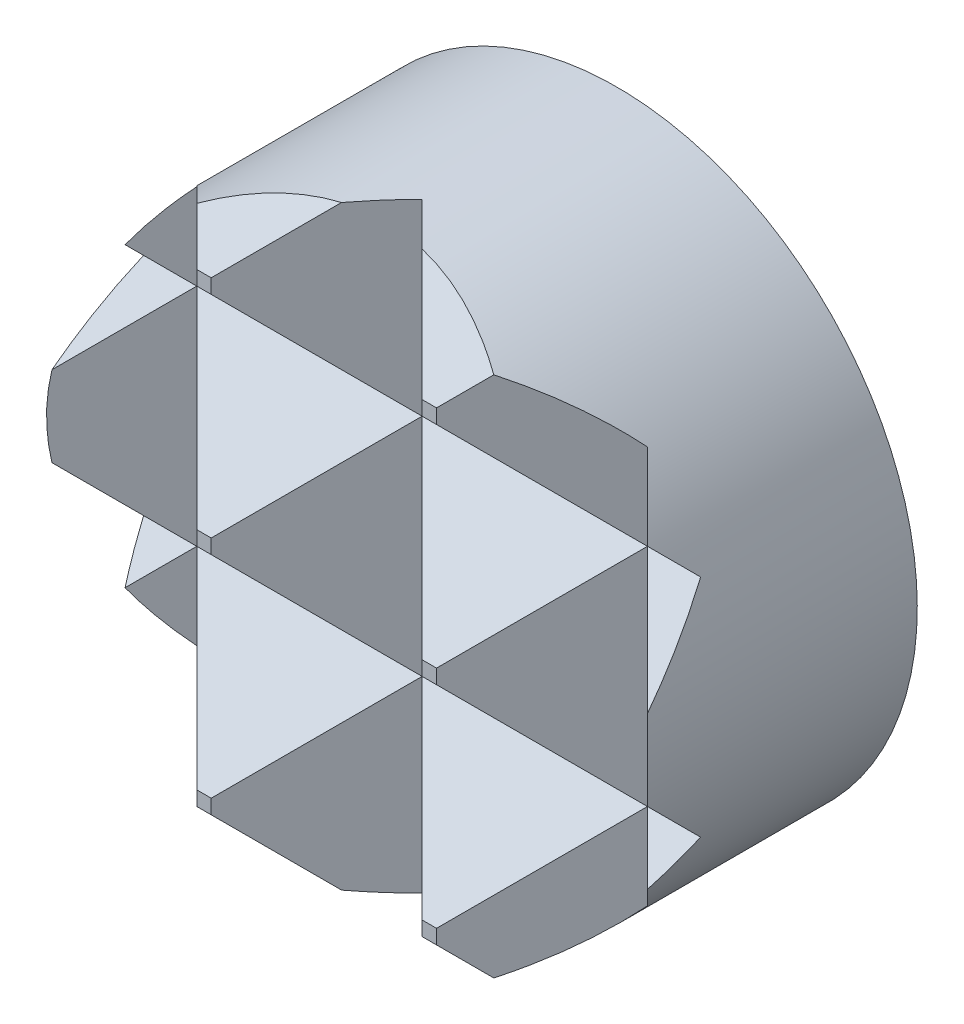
ISO-10303-21;
HEADER;
FILE_DESCRIPTION(('STEP AP214'),'2;1');
FILE_NAME('part.step','',(''),(''),'','','');
FILE_SCHEMA(('AUTOMOTIVE_DESIGN { 1 0 10303 214 1 1 1 1 }'));
ENDSEC;
DATA;
#1=APPLICATION_CONTEXT('core data for automotive mechanical design processes');
#2=APPLICATION_PROTOCOL_DEFINITION('international standard','automotive_design',2000,#1);
#3=PRODUCT_CONTEXT('',#1,'mechanical');
#4=PRODUCT('Part','Part','',(#3));
#5=PRODUCT_RELATED_PRODUCT_CATEGORY('part','',(#4));
#6=PRODUCT_DEFINITION_FORMATION('','',#4);
#7=PRODUCT_DEFINITION_CONTEXT('part definition',#1,'design');
#8=PRODUCT_DEFINITION('design','',#6,#7);
#9=PRODUCT_DEFINITION_SHAPE('','',#8);
#10=(LENGTH_UNIT() NAMED_UNIT(*) SI_UNIT(.MILLI.,.METRE.));
#11=(NAMED_UNIT(*) PLANE_ANGLE_UNIT() SI_UNIT($,.RADIAN.));
#12=(NAMED_UNIT(*) SI_UNIT($,.STERADIAN.) SOLID_ANGLE_UNIT());
#13=UNCERTAINTY_MEASURE_WITH_UNIT(LENGTH_MEASURE(1.E-05),#10,'distance_accuracy_value','');
#14=(GEOMETRIC_REPRESENTATION_CONTEXT(3) GLOBAL_UNCERTAINTY_ASSIGNED_CONTEXT((#13)) GLOBAL_UNIT_ASSIGNED_CONTEXT((#10,
#11,#12)) REPRESENTATION_CONTEXT('',''));
#15=CARTESIAN_POINT('',(0.,0.,0.));
#16=DIRECTION('',(0.,0.,1.));
#17=DIRECTION('',(1.,0.,0.));
#18=AXIS2_PLACEMENT_3D('',#15,#16,#17);
#19=CARTESIAN_POINT('',(3.94655948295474,1.190625,2.5654));
#20=DIRECTION('',(0.,0.707106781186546,-0.707106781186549));
#21=DIRECTION('',(0.,0.707106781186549,0.707106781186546));
#22=AXIS2_PLACEMENT_3D('',#19,#20,#21);
#23=PLANE('',#22);
#24=CARTESIAN_POINT('',(0.,0.,1.374775));
#25=DIRECTION('',(0.,0.707106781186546,-0.707106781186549));
#26=DIRECTION('',(0.,0.707106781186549,0.707106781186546));
#27=AXIS2_PLACEMENT_3D('',#24,#25,#26);
#28=ELLIPSE('',#27,4.49012806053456,3.175);
#29=CARTESIAN_POINT('',(2.76001006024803,1.56938506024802,2.94416006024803));
#30=VERTEX_POINT('',#29);
#31=CARTESIAN_POINT('',(2.94330377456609,1.190625,2.5654));
#32=VERTEX_POINT('',#31);
#33=EDGE_CURVE('E258',#30,#32,#28,.T.);
#34=ORIENTED_EDGE('',*,*,#33,.F.);
#35=DIRECTION('',(-0.577350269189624,-0.577350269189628,-0.577350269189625));
#36=VECTOR('',#35,1.);
#37=CARTESIAN_POINT('',(2.90301982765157,1.71239482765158,3.08716982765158));
#38=LINE('',#37,#36);
#39=CARTESIAN_POINT('',(2.38125,1.190625,2.5654));
#40=VERTEX_POINT('',#39);
#41=EDGE_CURVE('E442',#30,#40,#38,.T.);
#42=ORIENTED_EDGE('',*,*,#41,.T.);
#43=DIRECTION('',(-1.,0.,0.));
#44=VECTOR('',#43,1.);
#45=CARTESIAN_POINT('',(3.94655948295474,1.190625,2.5654));
#46=LINE('',#45,#44);
#47=EDGE_CURVE('E234',#32,#40,#46,.T.);
#48=ORIENTED_EDGE('',*,*,#47,.F.);
#49=EDGE_LOOP('',(#34,#42,#48));
#50=FACE_BOUND('',#49,.T.);
#51=ADVANCED_FACE('F14',(#50),#23,.F.);
#52=CARTESIAN_POINT('',(3.176025,1.190625,2.5654));
#53=DIRECTION('',(0.,-0.707106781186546,-0.70710678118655));
#54=DIRECTION('',(0.,0.70710678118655,-0.707106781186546));
#55=AXIS2_PLACEMENT_3D('',#52,#53,#54);
#56=PLANE('',#55);
#57=ORIENTED_EDGE('',*,*,#47,.T.);
#58=DIRECTION('',(0.577350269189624,-0.577350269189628,0.577350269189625));
#59=VECTOR('',#58,1.);
#60=CARTESIAN_POINT('',(2.646175,0.9257,2.830325));
#61=LINE('',#60,#59);
#62=CARTESIAN_POINT('',(3.14635645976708,0.425518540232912,3.33050645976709));
#63=VERTEX_POINT('',#62);
#64=EDGE_CURVE('E445',#40,#63,#61,.T.);
#65=ORIENTED_EDGE('',*,*,#64,.T.);
#66=CARTESIAN_POINT('',(0.,0.,3.756025));
#67=DIRECTION('',(0.,-0.707106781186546,-0.70710678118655));
#68=DIRECTION('',(0.,-0.70710678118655,0.707106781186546));
#69=AXIS2_PLACEMENT_3D('',#66,#67,#68);
#70=ELLIPSE('',#69,4.49012806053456,3.175);
#71=EDGE_CURVE('E266',#32,#63,#70,.T.);
#72=ORIENTED_EDGE('',*,*,#71,.F.);
#73=EDGE_LOOP('',(#57,#65,#72));
#74=FACE_BOUND('',#73,.T.);
#75=ADVANCED_FACE('F491',(#74),#56,.F.);
#76=CARTESIAN_POINT('',(3.176025,-1.190625,2.5654));
#77=DIRECTION('',(0.,0.707106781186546,-0.707106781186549));
#78=DIRECTION('',(0.,0.707106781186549,0.707106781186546));
#79=AXIS2_PLACEMENT_3D('',#76,#77,#78);
#80=PLANE('',#79);
#81=CARTESIAN_POINT('',(0.,0.,3.756025));
#82=DIRECTION('',(0.,0.707106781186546,-0.707106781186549));
#83=DIRECTION('',(0.,0.707106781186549,0.707106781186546));
#84=AXIS2_PLACEMENT_3D('',#81,#82,#83);
#85=ELLIPSE('',#84,4.49012806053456,3.175);
#86=CARTESIAN_POINT('',(3.14635645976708,-0.425518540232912,3.33050645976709));
#87=VERTEX_POINT('',#86);
#88=CARTESIAN_POINT('',(2.94330377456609,-1.190625,2.5654));
#89=VERTEX_POINT('',#88);
#90=EDGE_CURVE('E257',#87,#89,#85,.T.);
#91=ORIENTED_EDGE('',*,*,#90,.F.);
#92=DIRECTION('',(-0.577350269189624,-0.577350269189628,-0.577350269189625));
#93=VECTOR('',#92,1.);
#94=CARTESIAN_POINT('',(2.646175,-0.9257,2.830325));
#95=LINE('',#94,#93);
#96=CARTESIAN_POINT('',(2.38125,-1.190625,2.5654));
#97=VERTEX_POINT('',#96);
#98=EDGE_CURVE('E448',#87,#97,#95,.T.);
#99=ORIENTED_EDGE('',*,*,#98,.T.);
#100=DIRECTION('',(-1.,0.,0.));
#101=VECTOR('',#100,1.);
#102=CARTESIAN_POINT('',(3.176025,-1.190625,2.5654));
#103=LINE('',#102,#101);
#104=EDGE_CURVE('E269',#89,#97,#103,.T.);
#105=ORIENTED_EDGE('',*,*,#104,.F.);
#106=EDGE_LOOP('',(#91,#99,#105));
#107=FACE_BOUND('',#106,.T.);
#108=ADVANCED_FACE('F560',(#107),#80,.F.);
#109=CARTESIAN_POINT('',(3.571875,-1.190625,2.5654));
#110=DIRECTION('',(0.,-0.707106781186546,-0.70710678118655));
#111=DIRECTION('',(0.,0.70710678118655,-0.707106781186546));
#112=AXIS2_PLACEMENT_3D('',#109,#110,#111);
#113=PLANE('',#112);
#114=ORIENTED_EDGE('',*,*,#104,.T.);
#115=DIRECTION('',(0.577350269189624,-0.577350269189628,0.577350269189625));
#116=VECTOR('',#115,1.);
#117=CARTESIAN_POINT('',(2.778125,-1.5875,2.962275));
#118=LINE('',#117,#116);
#119=CARTESIAN_POINT('',(2.76001006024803,-1.56938506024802,2.94416006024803));
#120=VERTEX_POINT('',#119);
#121=EDGE_CURVE('E212',#97,#120,#118,.T.);
#122=ORIENTED_EDGE('',*,*,#121,.T.);
#123=CARTESIAN_POINT('',(0.,0.,1.374775));
#124=DIRECTION('',(0.,-0.707106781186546,-0.70710678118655));
#125=DIRECTION('',(0.,-0.70710678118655,0.707106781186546));
#126=AXIS2_PLACEMENT_3D('',#123,#124,#125);
#127=ELLIPSE('',#126,4.49012806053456,3.175);
#128=EDGE_CURVE('E221',#89,#120,#127,.T.);
#129=ORIENTED_EDGE('',*,*,#128,.F.);
#130=EDGE_LOOP('',(#114,#122,#129));
#131=FACE_BOUND('',#130,.T.);
#132=ADVANCED_FACE('F564',(#131),#113,.F.);
#133=CARTESIAN_POINT('',(0.,1.190625,2.5654));
#134=VERTEX_POINT('',#133);
#135=EDGE_CURVE('E18',#40,#134,#46,.T.);
#136=ORIENTED_EDGE('',*,*,#135,.F.);
#137=DIRECTION('',(-0.577350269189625,0.577350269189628,0.577350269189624));
#138=VECTOR('',#137,1.);
#139=CARTESIAN_POINT('',(2.90301982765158,0.668855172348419,2.04363017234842));
#140=LINE('',#139,#138);
#141=CARTESIAN_POINT('',(1.266825,2.30505,3.679825));
#142=VERTEX_POINT('',#141);
#143=EDGE_CURVE('E467',#40,#142,#140,.T.);
#144=ORIENTED_EDGE('',*,*,#143,.T.);
#145=DIRECTION('',(-1.,0.,0.));
#146=VECTOR('',#145,1.);
#147=CARTESIAN_POINT('',(3.94655948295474,2.30505,3.679825));
#148=LINE('',#147,#146);
#149=CARTESIAN_POINT('',(1.114425,2.30505,3.679825));
#150=VERTEX_POINT('',#149);
#151=EDGE_CURVE('E240',#142,#150,#148,.T.);
#152=ORIENTED_EDGE('',*,*,#151,.T.);
#153=DIRECTION('',(-0.577350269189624,-0.577350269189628,-0.577350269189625));
#154=VECTOR('',#153,1.);
#155=CARTESIAN_POINT('',(1.31551982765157,2.50614482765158,3.88091982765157));
#156=LINE('',#155,#154);
#157=EDGE_CURVE('E395',#150,#134,#156,.T.);
#158=ORIENTED_EDGE('',*,*,#157,.T.);
#159=EDGE_LOOP('',(#136,#144,#152,#158));
#160=FACE_BOUND('',#159,.T.);
#161=ADVANCED_FACE('F483',(#160),#23,.F.);
#162=DIRECTION('',(-1.,0.,0.));
#163=VECTOR('',#162,1.);
#164=CARTESIAN_POINT('',(3.176025,0.0761999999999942,3.679825));
#165=LINE('',#164,#163);
#166=CARTESIAN_POINT('',(1.266825,0.0761999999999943,3.679825));
#167=VERTEX_POINT('',#166);
#168=CARTESIAN_POINT('',(1.114425,0.0761999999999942,3.679825));
#169=VERTEX_POINT('',#168);
#170=EDGE_CURVE('E307',#167,#169,#165,.T.);
#171=ORIENTED_EDGE('',*,*,#170,.F.);
#172=DIRECTION('',(0.577350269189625,0.577350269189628,-0.577350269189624));
#173=VECTOR('',#172,1.);
#174=CARTESIAN_POINT('',(2.646175,1.45555,2.300475));
#175=LINE('',#174,#173);
#176=EDGE_CURVE('E464',#167,#40,#175,.T.);
#177=ORIENTED_EDGE('',*,*,#176,.T.);
#178=ORIENTED_EDGE('',*,*,#135,.T.);
#179=DIRECTION('',(0.577350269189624,-0.577350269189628,0.577350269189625));
#180=VECTOR('',#179,1.);
#181=CARTESIAN_POINT('',(1.058675,0.131949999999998,3.624075));
#182=LINE('',#181,#180);
#183=EDGE_CURVE('E397',#134,#169,#182,.T.);
#184=ORIENTED_EDGE('',*,*,#183,.T.);
#185=EDGE_LOOP('',(#171,#177,#178,#184));
#186=FACE_BOUND('',#185,.T.);
#187=ADVANCED_FACE('F487',(#186),#56,.F.);
#188=CARTESIAN_POINT('',(0.,-1.190625,2.5654));
#189=VERTEX_POINT('',#188);
#190=EDGE_CURVE('E315',#97,#189,#103,.T.);
#191=ORIENTED_EDGE('',*,*,#190,.F.);
#192=DIRECTION('',(-0.577350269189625,0.577350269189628,0.577350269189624));
#193=VECTOR('',#192,1.);
#194=CARTESIAN_POINT('',(2.646175,-1.45555,2.300475));
#195=LINE('',#194,#193);
#196=CARTESIAN_POINT('',(1.266825,-0.0761999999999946,3.679825));
#197=VERTEX_POINT('',#196);
#198=EDGE_CURVE('E458',#97,#197,#195,.T.);
#199=ORIENTED_EDGE('',*,*,#198,.T.);
#200=DIRECTION('',(-1.,0.,0.));
#201=VECTOR('',#200,1.);
#202=CARTESIAN_POINT('',(3.176025,-0.0761999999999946,3.679825));
#203=LINE('',#202,#201);
#204=CARTESIAN_POINT('',(1.114425,-0.0761999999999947,3.679825));
#205=VERTEX_POINT('',#204);
#206=EDGE_CURVE('E310',#197,#205,#203,.T.);
#207=ORIENTED_EDGE('',*,*,#206,.T.);
#208=DIRECTION('',(-0.577350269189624,-0.577350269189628,-0.577350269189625));
#209=VECTOR('',#208,1.);
#210=CARTESIAN_POINT('',(1.058675,-0.131949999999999,3.624075));
#211=LINE('',#210,#209);
#212=EDGE_CURVE('E403',#205,#189,#211,.T.);
#213=ORIENTED_EDGE('',*,*,#212,.T.);
#214=EDGE_LOOP('',(#191,#199,#207,#213));
#215=FACE_BOUND('',#214,.T.);
#216=ADVANCED_FACE('F529',(#215),#80,.F.);
#217=DIRECTION('',(-1.,0.,0.));
#218=VECTOR('',#217,1.);
#219=CARTESIAN_POINT('',(3.571875,-2.30505,3.679825));
#220=LINE('',#219,#218);
#221=CARTESIAN_POINT('',(1.266825,-2.30505,3.679825));
#222=VERTEX_POINT('',#221);
#223=CARTESIAN_POINT('',(1.114425,-2.30505,3.679825));
#224=VERTEX_POINT('',#223);
#225=EDGE_CURVE('E291',#222,#224,#220,.T.);
#226=ORIENTED_EDGE('',*,*,#225,.F.);
#227=DIRECTION('',(0.577350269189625,0.577350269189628,-0.577350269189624));
#228=VECTOR('',#227,1.);
#229=CARTESIAN_POINT('',(2.778125,-0.79375,2.168525));
#230=LINE('',#229,#228);
#231=EDGE_CURVE('E455',#222,#97,#230,.T.);
#232=ORIENTED_EDGE('',*,*,#231,.T.);
#233=ORIENTED_EDGE('',*,*,#190,.T.);
#234=DIRECTION('',(0.577350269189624,-0.577350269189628,0.577350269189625));
#235=VECTOR('',#234,1.);
#236=CARTESIAN_POINT('',(1.190625,-2.38125,3.756025));
#237=LINE('',#236,#235);
#238=EDGE_CURVE('E406',#189,#224,#237,.T.);
#239=ORIENTED_EDGE('',*,*,#238,.T.);
#240=EDGE_LOOP('',(#226,#232,#233,#239));
#241=FACE_BOUND('',#240,.T.);
#242=ADVANCED_FACE('F839',(#241),#113,.F.);
#243=CARTESIAN_POINT('',(3.94655948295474,2.45745,3.679825));
#244=DIRECTION('',(0.,0.,-1.));
#245=DIRECTION('',(-1.,0.,0.));
#246=AXIS2_PLACEMENT_3D('',#243,#244,#245);
#247=PLANE('',#246);
#248=ORIENTED_EDGE('',*,*,#151,.F.);
#249=DIRECTION('',(0.,1.,0.));
#250=VECTOR('',#249,1.);
#251=CARTESIAN_POINT('',(1.266825,2.45745,3.679825));
#252=LINE('',#251,#250);
#253=CARTESIAN_POINT('',(1.266825,2.45745,3.679825));
#254=VERTEX_POINT('',#253);
#255=EDGE_CURVE('E469',#142,#254,#252,.T.);
#256=ORIENTED_EDGE('',*,*,#255,.T.);
#257=DIRECTION('',(-1.,0.,0.));
#258=VECTOR('',#257,1.);
#259=CARTESIAN_POINT('',(3.94655948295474,2.45745,3.679825));
#260=LINE('',#259,#258);
#261=CARTESIAN_POINT('',(1.114425,2.45745,3.679825));
#262=VERTEX_POINT('',#261);
#263=EDGE_CURVE('E247',#254,#262,#260,.T.);
#264=ORIENTED_EDGE('',*,*,#263,.T.);
#265=DIRECTION('',(0.,-1.,0.));
#266=VECTOR('',#265,1.);
#267=CARTESIAN_POINT('',(1.114425,2.45745,3.679825));
#268=LINE('',#267,#266);
#269=EDGE_CURVE('E393',#262,#150,#268,.T.);
#270=ORIENTED_EDGE('',*,*,#269,.T.);
#271=EDGE_LOOP('',(#248,#256,#264,#270));
#272=FACE_BOUND('',#271,.T.);
#273=ADVANCED_FACE('F499',(#272),#247,.F.);
#274=CARTESIAN_POINT('',(3.94655948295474,3.571875,2.5654));
#275=DIRECTION('',(0.,-0.707106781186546,-0.70710678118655));
#276=DIRECTION('',(0.,0.70710678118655,-0.707106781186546));
#277=AXIS2_PLACEMENT_3D('',#274,#275,#276);
#278=PLANE('',#277);
#279=ORIENTED_EDGE('',*,*,#263,.F.);
#280=DIRECTION('',(0.577350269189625,0.577350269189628,-0.577350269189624));
#281=VECTOR('',#280,1.);
#282=CARTESIAN_POINT('',(2.90301982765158,4.09364482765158,2.04363017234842));
#283=LINE('',#282,#281);
#284=CARTESIAN_POINT('',(1.56938506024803,2.76001006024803,3.37726493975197));
#285=VERTEX_POINT('',#284);
#286=EDGE_CURVE('E214',#254,#285,#283,.T.);
#287=ORIENTED_EDGE('',*,*,#286,.T.);
#288=CARTESIAN_POINT('',(0.,0.,6.137275));
#289=DIRECTION('',(0.,-0.707106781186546,-0.70710678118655));
#290=DIRECTION('',(0.,-0.70710678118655,0.707106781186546));
#291=AXIS2_PLACEMENT_3D('',#288,#289,#290);
#292=ELLIPSE('',#291,4.49012806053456,3.175);
#293=CARTESIAN_POINT('',(0.425518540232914,3.14635645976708,2.99091854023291));
#294=VERTEX_POINT('',#293);
#295=EDGE_CURVE('E256',#294,#285,#292,.T.);
#296=ORIENTED_EDGE('',*,*,#295,.F.);
#297=DIRECTION('',(0.577350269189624,-0.577350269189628,0.577350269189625));
#298=VECTOR('',#297,1.);
#299=CARTESIAN_POINT('',(1.31551982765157,2.25635517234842,3.88091982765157));
#300=LINE('',#299,#298);
#301=EDGE_CURVE('E390',#294,#262,#300,.T.);
#302=ORIENTED_EDGE('',*,*,#301,.T.);
#303=EDGE_LOOP('',(#279,#287,#296,#302));
#304=FACE_BOUND('',#303,.T.);
#305=ADVANCED_FACE('F498',(#304),#278,.F.);
#306=CARTESIAN_POINT('',(3.176025,0.0761999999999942,3.679825));
#307=DIRECTION('',(0.,0.,-1.));
#308=DIRECTION('',(-1.,0.,0.));
#309=AXIS2_PLACEMENT_3D('',#306,#307,#308);
#310=PLANE('',#309);
#311=ORIENTED_EDGE('',*,*,#206,.F.);
#312=DIRECTION('',(0.,1.,0.));
#313=VECTOR('',#312,1.);
#314=CARTESIAN_POINT('',(1.266825,0.0761999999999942,3.679825));
#315=LINE('',#314,#313);
#316=EDGE_CURVE('E461',#197,#167,#315,.T.);
#317=ORIENTED_EDGE('',*,*,#316,.T.);
#318=ORIENTED_EDGE('',*,*,#170,.T.);
#319=DIRECTION('',(0.,-1.,0.));
#320=VECTOR('',#319,1.);
#321=CARTESIAN_POINT('',(1.114425,0.0761999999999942,3.679825));
#322=LINE('',#321,#320);
#323=EDGE_CURVE('E400',#169,#205,#322,.T.);
#324=ORIENTED_EDGE('',*,*,#323,.T.);
#325=EDGE_LOOP('',(#311,#317,#318,#324));
#326=FACE_BOUND('',#325,.T.);
#327=ADVANCED_FACE('F532',(#326),#310,.F.);
#328=CARTESIAN_POINT('',(3.571875,-3.571875,2.5654));
#329=DIRECTION('',(0.,0.707106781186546,-0.707106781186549));
#330=DIRECTION('',(0.,0.707106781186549,0.707106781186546));
#331=AXIS2_PLACEMENT_3D('',#328,#329,#330);
#332=PLANE('',#331);
#333=CARTESIAN_POINT('',(0.,0.,6.137275));
#334=DIRECTION('',(0.,0.707106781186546,-0.707106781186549));
#335=DIRECTION('',(0.,0.707106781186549,0.707106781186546));
#336=AXIS2_PLACEMENT_3D('',#333,#334,#335);
#337=ELLIPSE('',#336,4.49012806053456,3.175);
#338=CARTESIAN_POINT('',(1.56938506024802,-2.76001006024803,3.37726493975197));
#339=VERTEX_POINT('',#338);
#340=CARTESIAN_POINT('',(0.425518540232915,-3.14635645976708,2.99091854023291));
#341=VERTEX_POINT('',#340);
#342=EDGE_CURVE('E298',#339,#341,#337,.T.);
#343=ORIENTED_EDGE('',*,*,#342,.F.);
#344=DIRECTION('',(-0.577350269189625,0.577350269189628,0.577350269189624));
#345=VECTOR('',#344,1.);
#346=CARTESIAN_POINT('',(2.778125,-3.96875,2.168525));
#347=LINE('',#346,#345);
#348=CARTESIAN_POINT('',(1.266825,-2.45745,3.679825));
#349=VERTEX_POINT('',#348);
#350=EDGE_CURVE('E203',#339,#349,#347,.T.);
#351=ORIENTED_EDGE('',*,*,#350,.T.);
#352=DIRECTION('',(-1.,0.,0.));
#353=VECTOR('',#352,1.);
#354=CARTESIAN_POINT('',(3.571875,-2.45745,3.679825));
#355=LINE('',#354,#353);
#356=CARTESIAN_POINT('',(1.114425,-2.45745,3.679825));
#357=VERTEX_POINT('',#356);
#358=EDGE_CURVE('E292',#349,#357,#355,.T.);
#359=ORIENTED_EDGE('',*,*,#358,.T.);
#360=DIRECTION('',(-0.577350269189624,-0.577350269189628,-0.577350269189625));
#361=VECTOR('',#360,1.);
#362=CARTESIAN_POINT('',(1.190625,-2.38125,3.756025));
#363=LINE('',#362,#361);
#364=EDGE_CURVE('E412',#357,#341,#363,.T.);
#365=ORIENTED_EDGE('',*,*,#364,.T.);
#366=EDGE_LOOP('',(#343,#351,#359,#365));
#367=FACE_BOUND('',#366,.T.);
#368=ADVANCED_FACE('F534',(#367),#332,.F.);
#369=CARTESIAN_POINT('',(3.571875,-2.30505,3.679825));
#370=DIRECTION('',(0.,0.,-1.));
#371=DIRECTION('',(-1.,0.,0.));
#372=AXIS2_PLACEMENT_3D('',#369,#370,#371);
#373=PLANE('',#372);
#374=ORIENTED_EDGE('',*,*,#358,.F.);
#375=DIRECTION('',(0.,1.,0.));
#376=VECTOR('',#375,1.);
#377=CARTESIAN_POINT('',(1.266825,-2.30505,3.679825));
#378=LINE('',#377,#376);
#379=EDGE_CURVE('E452',#349,#222,#378,.T.);
#380=ORIENTED_EDGE('',*,*,#379,.T.);
#381=ORIENTED_EDGE('',*,*,#225,.T.);
#382=DIRECTION('',(0.,-1.,0.));
#383=VECTOR('',#382,1.);
#384=CARTESIAN_POINT('',(1.114425,-2.30505,3.679825));
#385=LINE('',#384,#383);
#386=EDGE_CURVE('E225',#224,#357,#385,.T.);
#387=ORIENTED_EDGE('',*,*,#386,.T.);
#388=EDGE_LOOP('',(#374,#380,#381,#387));
#389=FACE_BOUND('',#388,.T.);
#390=ADVANCED_FACE('F542',(#389),#373,.F.);
#391=CARTESIAN_POINT('',(-2.38125,1.190625,2.5654));
#392=VERTEX_POINT('',#391);
#393=EDGE_CURVE('E231',#134,#392,#46,.T.);
#394=ORIENTED_EDGE('',*,*,#393,.F.);
#395=DIRECTION('',(-0.577350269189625,0.577350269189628,0.577350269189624));
#396=VECTOR('',#395,1.);
#397=CARTESIAN_POINT('',(1.31551982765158,-0.124894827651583,1.24988017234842));
#398=LINE('',#397,#396);
#399=CARTESIAN_POINT('',(-1.114425,2.30505,3.679825));
#400=VERTEX_POINT('',#399);
#401=EDGE_CURVE('E343',#134,#400,#398,.T.);
#402=ORIENTED_EDGE('',*,*,#401,.T.);
#403=CARTESIAN_POINT('',(-1.266825,2.30505,3.679825));
#404=VERTEX_POINT('',#403);
#405=EDGE_CURVE('E239',#400,#404,#148,.T.);
#406=ORIENTED_EDGE('',*,*,#405,.T.);
#407=DIRECTION('',(-0.577350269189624,-0.577350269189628,-0.577350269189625));
#408=VECTOR('',#407,1.);
#409=CARTESIAN_POINT('',(-0.271980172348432,3.29989482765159,4.67466982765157));
#410=LINE('',#409,#408);
#411=EDGE_CURVE('E340',#404,#392,#410,.T.);
#412=ORIENTED_EDGE('',*,*,#411,.T.);
#413=EDGE_LOOP('',(#394,#402,#406,#412));
#414=FACE_BOUND('',#413,.T.);
#415=ADVANCED_FACE('F339',(#414),#23,.F.);
#416=CARTESIAN_POINT('',(-1.114425,0.0761999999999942,3.679825));
#417=VERTEX_POINT('',#416);
#418=CARTESIAN_POINT('',(-1.266825,0.0761999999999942,3.679825));
#419=VERTEX_POINT('',#418);
#420=EDGE_CURVE('E264',#417,#419,#165,.T.);
#421=ORIENTED_EDGE('',*,*,#420,.F.);
#422=DIRECTION('',(0.577350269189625,0.577350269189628,-0.577350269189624));
#423=VECTOR('',#422,1.);
#424=CARTESIAN_POINT('',(1.058675,2.2493,1.506725));
#425=LINE('',#424,#423);
#426=EDGE_CURVE('E422',#417,#134,#425,.T.);
#427=ORIENTED_EDGE('',*,*,#426,.T.);
#428=ORIENTED_EDGE('',*,*,#393,.T.);
#429=DIRECTION('',(0.577350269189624,-0.577350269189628,0.577350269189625));
#430=VECTOR('',#429,1.);
#431=CARTESIAN_POINT('',(-0.528825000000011,-0.6618,4.417825));
#432=LINE('',#431,#430);
#433=EDGE_CURVE('E353',#392,#419,#432,.T.);
#434=ORIENTED_EDGE('',*,*,#433,.T.);
#435=EDGE_LOOP('',(#421,#427,#428,#434));
#436=FACE_BOUND('',#435,.T.);
#437=ADVANCED_FACE('F576',(#436),#56,.F.);
#438=CARTESIAN_POINT('',(-2.38125,-1.190625,2.5654));
#439=VERTEX_POINT('',#438);
#440=EDGE_CURVE('E949',#189,#439,#103,.T.);
#441=ORIENTED_EDGE('',*,*,#440,.F.);
#442=DIRECTION('',(-0.577350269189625,0.577350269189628,0.577350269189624));
#443=VECTOR('',#442,1.);
#444=CARTESIAN_POINT('',(1.058675,-2.2493,1.506725));
#445=LINE('',#444,#443);
#446=CARTESIAN_POINT('',(-1.114425,-0.0761999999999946,3.679825));
#447=VERTEX_POINT('',#446);
#448=EDGE_CURVE('E428',#189,#447,#445,.T.);
#449=ORIENTED_EDGE('',*,*,#448,.T.);
#450=CARTESIAN_POINT('',(-1.266825,-0.0761999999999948,3.679825));
#451=VERTEX_POINT('',#450);
#452=EDGE_CURVE('E309',#447,#451,#203,.T.);
#453=ORIENTED_EDGE('',*,*,#452,.T.);
#454=DIRECTION('',(-0.577350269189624,-0.577350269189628,-0.577350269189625));
#455=VECTOR('',#454,1.);
#456=CARTESIAN_POINT('',(-0.528825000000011,0.6618,4.417825));
#457=LINE('',#456,#455);
#458=EDGE_CURVE('E366',#451,#439,#457,.T.);
#459=ORIENTED_EDGE('',*,*,#458,.T.);
#460=EDGE_LOOP('',(#441,#449,#453,#459));
#461=FACE_BOUND('',#460,.T.);
#462=ADVANCED_FACE('F581',(#461),#80,.F.);
#463=CARTESIAN_POINT('',(-1.114425,-2.30505,3.679825));
#464=VERTEX_POINT('',#463);
#465=CARTESIAN_POINT('',(-1.266825,-2.30505,3.679825));
#466=VERTEX_POINT('',#465);
#467=EDGE_CURVE('E280',#464,#466,#220,.T.);
#468=ORIENTED_EDGE('',*,*,#467,.F.);
#469=DIRECTION('',(0.577350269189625,0.577350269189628,-0.577350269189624));
#470=VECTOR('',#469,1.);
#471=CARTESIAN_POINT('',(1.190625,0.,1.374775));
#472=LINE('',#471,#470);
#473=EDGE_CURVE('E288',#464,#189,#472,.T.);
#474=ORIENTED_EDGE('',*,*,#473,.T.);
#475=ORIENTED_EDGE('',*,*,#440,.T.);
#476=DIRECTION('',(0.577350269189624,-0.577350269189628,0.577350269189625));
#477=VECTOR('',#476,1.);
#478=CARTESIAN_POINT('',(-0.396875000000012,-3.175,4.549775));
#479=LINE('',#478,#477);
#480=EDGE_CURVE('E272',#439,#466,#479,.T.);
#481=ORIENTED_EDGE('',*,*,#480,.T.);
#482=EDGE_LOOP('',(#468,#474,#475,#481));
#483=FACE_BOUND('',#482,.T.);
#484=ADVANCED_FACE('F287',(#483),#113,.F.);
#485=CARTESIAN_POINT('',(0.,0.,0.));
#486=DIRECTION('',(0.,0.,1.));
#487=DIRECTION('',(1.,0.,0.));
#488=AXIS2_PLACEMENT_3D('',#485,#486,#487);
#489=CYLINDRICAL_SURFACE('',#488,3.175);
#490=CARTESIAN_POINT('',(0.,0.,0.18415));
#491=DIRECTION('',(0.707106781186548,0.,-0.707106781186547));
#492=DIRECTION('',(0.707106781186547,0.,0.707106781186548));
#493=AXIS2_PLACEMENT_3D('',#490,#491,#492);
#494=ELLIPSE('',#493,4.49012806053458,3.175);
#495=EDGE_CURVE('E9',#87,#63,#494,.F.);
#496=ORIENTED_EDGE('',*,*,#495,.F.);
#497=ORIENTED_EDGE('',*,*,#90,.T.);
#498=ORIENTED_EDGE('',*,*,#128,.T.);
#499=CARTESIAN_POINT('',(2.38125,-2.10006510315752,2.5654));
#500=VERTEX_POINT('',#499);
#501=EDGE_CURVE('E24',#500,#120,#494,.F.);
#502=ORIENTED_EDGE('',*,*,#501,.F.);
#503=CARTESIAN_POINT('',(0.,0.,4.94665));
#504=DIRECTION('',(-0.707106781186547,0.,-0.707106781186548));
#505=DIRECTION('',(-0.707106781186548,0.,0.707106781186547));
#506=AXIS2_PLACEMENT_3D('',#503,#504,#505);
#507=ELLIPSE('',#506,4.49012806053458,3.175);
#508=EDGE_CURVE('E200',#339,#500,#507,.F.);
#509=ORIENTED_EDGE('',*,*,#508,.F.);
#510=ORIENTED_EDGE('',*,*,#342,.T.);
#511=CARTESIAN_POINT('',(0.,0.,2.5654));
#512=DIRECTION('',(0.707106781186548,0.,-0.707106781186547));
#513=DIRECTION('',(0.707106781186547,0.,0.707106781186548));
#514=AXIS2_PLACEMENT_3D('',#511,#512,#513);
#515=ELLIPSE('',#514,4.49012806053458,3.175);
#516=CARTESIAN_POINT('',(0.,-3.175,2.5654));
#517=VERTEX_POINT('',#516);
#518=EDGE_CURVE('E409',#517,#341,#515,.F.);
#519=ORIENTED_EDGE('',*,*,#518,.F.);
#520=CARTESIAN_POINT('',(0.,0.,2.5654));
#521=DIRECTION('',(-0.707106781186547,0.,-0.707106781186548));
#522=DIRECTION('',(-0.707106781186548,0.,0.707106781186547));
#523=AXIS2_PLACEMENT_3D('',#520,#521,#522);
#524=ELLIPSE('',#523,4.49012806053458,3.175);
#525=CARTESIAN_POINT('',(-0.425518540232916,-3.14635645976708,2.99091854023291));
#526=VERTEX_POINT('',#525);
#527=EDGE_CURVE('E432',#526,#517,#524,.F.);
#528=ORIENTED_EDGE('',*,*,#527,.F.);
#529=CARTESIAN_POINT('',(-1.56938506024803,-2.76001006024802,3.37726493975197));
#530=VERTEX_POINT('',#529);
#531=EDGE_CURVE('E300',#526,#530,#337,.T.);
#532=ORIENTED_EDGE('',*,*,#531,.T.);
#533=CARTESIAN_POINT('',(0.,0.,4.94665));
#534=DIRECTION('',(0.707106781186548,0.,-0.707106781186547));
#535=DIRECTION('',(0.707106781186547,0.,0.707106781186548));
#536=AXIS2_PLACEMENT_3D('',#533,#534,#535);
#537=ELLIPSE('',#536,4.49012806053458,3.175);
#538=CARTESIAN_POINT('',(-2.38125,-2.10006510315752,2.5654));
#539=VERTEX_POINT('',#538);
#540=EDGE_CURVE('E352',#539,#530,#537,.F.);
#541=ORIENTED_EDGE('',*,*,#540,.F.);
#542=CARTESIAN_POINT('',(0.,0.,0.18415));
#543=DIRECTION('',(-0.707106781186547,0.,-0.707106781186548));
#544=DIRECTION('',(-0.707106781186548,0.,0.707106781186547));
#545=AXIS2_PLACEMENT_3D('',#542,#543,#544);
#546=ELLIPSE('',#545,4.49012806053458,3.175);
#547=CARTESIAN_POINT('',(-2.76001006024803,-1.56938506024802,2.94416006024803));
#548=VERTEX_POINT('',#547);
#549=EDGE_CURVE('E380',#548,#539,#546,.F.);
#550=ORIENTED_EDGE('',*,*,#549,.F.);
#551=CARTESIAN_POINT('',(0.,0.,1.374775));
#552=DIRECTION('',(0.,0.707106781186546,0.70710678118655));
#553=DIRECTION('',(0.,-0.70710678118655,0.707106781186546));
#554=AXIS2_PLACEMENT_3D('',#551,#552,#553);
#555=ELLIPSE('',#554,4.49012806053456,3.175);
#556=CARTESIAN_POINT('',(-2.94330377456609,-1.190625,2.5654));
#557=VERTEX_POINT('',#556);
#558=EDGE_CURVE('E294',#557,#548,#555,.T.);
#559=ORIENTED_EDGE('',*,*,#558,.F.);
#560=CARTESIAN_POINT('',(0.,0.,3.756025));
#561=DIRECTION('',(0.,-0.707106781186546,0.707106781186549));
#562=DIRECTION('',(0.,0.707106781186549,0.707106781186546));
#563=AXIS2_PLACEMENT_3D('',#560,#561,#562);
#564=ELLIPSE('',#563,4.49012806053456,3.175);
#565=CARTESIAN_POINT('',(-3.14635645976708,-0.425518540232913,3.33050645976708));
#566=VERTEX_POINT('',#565);
#567=EDGE_CURVE('E265',#566,#557,#564,.T.);
#568=ORIENTED_EDGE('',*,*,#567,.F.);
#569=CARTESIAN_POINT('',(-3.14635645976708,0.425518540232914,3.33050645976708));
#570=VERTEX_POINT('',#569);
#571=EDGE_CURVE('E381',#570,#566,#546,.F.);
#572=ORIENTED_EDGE('',*,*,#571,.F.);
#573=CARTESIAN_POINT('',(0.,0.,3.756025));
#574=DIRECTION('',(0.,0.707106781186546,0.70710678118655));
#575=DIRECTION('',(0.,-0.70710678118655,0.707106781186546));
#576=AXIS2_PLACEMENT_3D('',#573,#574,#575);
#577=ELLIPSE('',#576,4.49012806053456,3.175);
#578=CARTESIAN_POINT('',(-2.94330377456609,1.190625,2.5654));
#579=VERTEX_POINT('',#578);
#580=EDGE_CURVE('E261',#579,#570,#577,.T.);
#581=ORIENTED_EDGE('',*,*,#580,.F.);
#582=CARTESIAN_POINT('',(0.,0.,1.374775));
#583=DIRECTION('',(0.,-0.707106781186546,0.707106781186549));
#584=DIRECTION('',(0.,0.707106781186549,0.707106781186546));
#585=AXIS2_PLACEMENT_3D('',#582,#583,#584);
#586=ELLIPSE('',#585,4.49012806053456,3.175);
#587=CARTESIAN_POINT('',(-2.76001006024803,1.56938506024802,2.94416006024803));
#588=VERTEX_POINT('',#587);
#589=EDGE_CURVE('E254',#588,#579,#586,.T.);
#590=ORIENTED_EDGE('',*,*,#589,.F.);
#591=CARTESIAN_POINT('',(-2.38125,2.10006510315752,2.5654));
#592=VERTEX_POINT('',#591);
#593=EDGE_CURVE('E374',#592,#588,#546,.F.);
#594=ORIENTED_EDGE('',*,*,#593,.F.);
#595=CARTESIAN_POINT('',(-1.56938506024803,2.76001006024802,3.37726493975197));
#596=VERTEX_POINT('',#595);
#597=EDGE_CURVE('E302',#596,#592,#537,.F.);
#598=ORIENTED_EDGE('',*,*,#597,.F.);
#599=CARTESIAN_POINT('',(-0.425518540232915,3.14635645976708,2.99091854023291));
#600=VERTEX_POINT('',#599);
#601=EDGE_CURVE('E260',#596,#600,#292,.T.);
#602=ORIENTED_EDGE('',*,*,#601,.T.);
#603=CARTESIAN_POINT('',(0.,3.175,2.5654));
#604=VERTEX_POINT('',#603);
#605=EDGE_CURVE('E415',#604,#600,#524,.F.);
#606=ORIENTED_EDGE('',*,*,#605,.F.);
#607=EDGE_CURVE('E389',#294,#604,#515,.F.);
#608=ORIENTED_EDGE('',*,*,#607,.F.);
#609=ORIENTED_EDGE('',*,*,#295,.T.);
#610=CARTESIAN_POINT('',(2.38125,2.10006510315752,2.5654));
#611=VERTEX_POINT('',#610);
#612=EDGE_CURVE('E208',#611,#285,#507,.F.);
#613=ORIENTED_EDGE('',*,*,#612,.F.);
#614=EDGE_CURVE('E25',#30,#611,#494,.F.);
#615=ORIENTED_EDGE('',*,*,#614,.F.);
#616=ORIENTED_EDGE('',*,*,#33,.T.);
#617=ORIENTED_EDGE('',*,*,#71,.T.);
#618=EDGE_LOOP('',(#496,#497,#498,#502,#509,#510,#519,#528,#532,#541,#550,#559,#568,#572,#581,
#590,#594,#598,#602,#606,#608,#609,#613,#615,#616,#617));
#619=FACE_BOUND('',#618,.T.);
#620=CARTESIAN_POINT('',(0.,0.,0.508));
#621=DIRECTION('',(0.,0.,-1.));
#622=DIRECTION('',(-1.,0.,0.));
#623=AXIS2_PLACEMENT_3D('',#620,#621,#622);
#624=CIRCLE('',#623,3.175);
#625=CARTESIAN_POINT('',(-3.175,0.,0.508));
#626=VERTEX_POINT('',#625);
#627=EDGE_CURVE('E246',#626,#626,#624,.T.);
#628=ORIENTED_EDGE('',*,*,#627,.F.);
#629=EDGE_LOOP('',(#628));
#630=FACE_BOUND('',#629,.T.);
#631=ADVANCED_FACE('F16',(#619,#630),#489,.T.);
#632=CARTESIAN_POINT('',(0.,0.,0.508));
#633=DIRECTION('',(0.,0.,-1.));
#634=DIRECTION('',(-1.,0.,0.));
#635=AXIS2_PLACEMENT_3D('',#632,#633,#634);
#636=PLANE('',#635);
#637=CARTESIAN_POINT('',(0.,0.,0.508));
#638=DIRECTION('',(0.,0.,-1.));
#639=DIRECTION('',(-1.,0.,0.));
#640=AXIS2_PLACEMENT_3D('',#637,#638,#639);
#641=CIRCLE('',#640,2.921);
#642=CARTESIAN_POINT('',(-2.921,0.,0.508));
#643=VERTEX_POINT('',#642);
#644=EDGE_CURVE('E242',#643,#643,#641,.T.);
#645=ORIENTED_EDGE('',*,*,#644,.F.);
#646=EDGE_LOOP('',(#645));
#647=FACE_BOUND('',#646,.T.);
#648=ORIENTED_EDGE('',*,*,#627,.T.);
#649=EDGE_LOOP('',(#648));
#650=FACE_BOUND('',#649,.T.);
#651=ADVANCED_FACE('F814',(#647,#650),#636,.T.);
#652=CARTESIAN_POINT('',(0.,0.,0.));
#653=DIRECTION('',(0.,0.,1.));
#654=DIRECTION('',(1.,0.,0.));
#655=AXIS2_PLACEMENT_3D('',#652,#653,#654);
#656=PLANE('',#655);
#657=CARTESIAN_POINT('',(0.,0.,0.));
#658=DIRECTION('',(0.,0.,1.));
#659=DIRECTION('',(1.,0.,0.));
#660=AXIS2_PLACEMENT_3D('',#657,#658,#659);
#661=CIRCLE('',#660,2.413);
#662=CARTESIAN_POINT('',(2.413,0.,0.));
#663=VERTEX_POINT('',#662);
#664=EDGE_CURVE('E250',#663,#663,#661,.F.);
#665=ORIENTED_EDGE('',*,*,#664,.T.);
#666=EDGE_LOOP('',(#665));
#667=FACE_BOUND('',#666,.T.);
#668=ADVANCED_FACE('F572',(#667),#656,.F.);
#669=CARTESIAN_POINT('',(0.,0.,0.));
#670=DIRECTION('',(0.,0.,1.));
#671=DIRECTION('',(1.,0.,0.));
#672=AXIS2_PLACEMENT_3D('',#669,#670,#671);
#673=CONICAL_SURFACE('',#672,2.413,0.785398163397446);
#674=ORIENTED_EDGE('',*,*,#644,.T.);
#675=EDGE_LOOP('',(#674));
#676=FACE_BOUND('',#675,.T.);
#677=ORIENTED_EDGE('',*,*,#664,.F.);
#678=EDGE_LOOP('',(#677));
#679=FACE_BOUND('',#678,.T.);
#680=ADVANCED_FACE('F566',(#676,#679),#673,.T.);
#681=EDGE_CURVE('E232',#392,#579,#46,.T.);
#682=ORIENTED_EDGE('',*,*,#681,.F.);
#683=DIRECTION('',(-0.577350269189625,0.577350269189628,0.577350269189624));
#684=VECTOR('',#683,1.);
#685=CARTESIAN_POINT('',(-0.271980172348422,-0.918644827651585,0.456130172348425));
#686=LINE('',#685,#684);
#687=EDGE_CURVE('E375',#392,#588,#686,.T.);
#688=ORIENTED_EDGE('',*,*,#687,.T.);
#689=ORIENTED_EDGE('',*,*,#589,.T.);
#690=EDGE_LOOP('',(#682,#688,#689));
#691=FACE_BOUND('',#690,.T.);
#692=ADVANCED_FACE('F556',(#691),#23,.F.);
#693=ORIENTED_EDGE('',*,*,#405,.F.);
#694=DIRECTION('',(0.,1.,0.));
#695=VECTOR('',#694,1.);
#696=CARTESIAN_POINT('',(-1.114425,2.45745,3.679825));
#697=LINE('',#696,#695);
#698=CARTESIAN_POINT('',(-1.114425,2.45745,3.679825));
#699=VERTEX_POINT('',#698);
#700=EDGE_CURVE('E419',#400,#699,#697,.T.);
#701=ORIENTED_EDGE('',*,*,#700,.T.);
#702=CARTESIAN_POINT('',(-1.266825,2.45745,3.679825));
#703=VERTEX_POINT('',#702);
#704=EDGE_CURVE('E317',#699,#703,#260,.T.);
#705=ORIENTED_EDGE('',*,*,#704,.T.);
#706=DIRECTION('',(0.,-1.,0.));
#707=VECTOR('',#706,1.);
#708=CARTESIAN_POINT('',(-1.266825,2.45745,3.679825));
#709=LINE('',#708,#707);
#710=EDGE_CURVE('E347',#703,#404,#709,.T.);
#711=ORIENTED_EDGE('',*,*,#710,.T.);
#712=EDGE_LOOP('',(#693,#701,#705,#711));
#713=FACE_BOUND('',#712,.T.);
#714=ADVANCED_FACE('F355',(#713),#247,.F.);
#715=ORIENTED_EDGE('',*,*,#704,.F.);
#716=DIRECTION('',(0.577350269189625,0.577350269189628,-0.577350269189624));
#717=VECTOR('',#716,1.);
#718=CARTESIAN_POINT('',(1.31551982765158,4.88739482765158,1.24988017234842));
#719=LINE('',#718,#717);
#720=EDGE_CURVE('E416',#699,#600,#719,.T.);
#721=ORIENTED_EDGE('',*,*,#720,.T.);
#722=ORIENTED_EDGE('',*,*,#601,.F.);
#723=DIRECTION('',(0.577350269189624,-0.577350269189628,0.577350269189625));
#724=VECTOR('',#723,1.);
#725=CARTESIAN_POINT('',(-0.271980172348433,1.46260517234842,4.67466982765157));
#726=LINE('',#725,#724);
#727=EDGE_CURVE('E356',#596,#703,#726,.T.);
#728=ORIENTED_EDGE('',*,*,#727,.T.);
#729=EDGE_LOOP('',(#715,#721,#722,#728));
#730=FACE_BOUND('',#729,.T.);
#731=ADVANCED_FACE('F547',(#730),#278,.F.);
#732=ORIENTED_EDGE('',*,*,#580,.T.);
#733=DIRECTION('',(0.577350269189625,0.577350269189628,-0.577350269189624));
#734=VECTOR('',#733,1.);
#735=CARTESIAN_POINT('',(-0.528825,3.04305,0.712975));
#736=LINE('',#735,#734);
#737=EDGE_CURVE('E378',#570,#392,#736,.T.);
#738=ORIENTED_EDGE('',*,*,#737,.T.);
#739=ORIENTED_EDGE('',*,*,#681,.T.);
#740=EDGE_LOOP('',(#732,#738,#739));
#741=FACE_BOUND('',#740,.T.);
#742=ADVANCED_FACE('F552',(#741),#56,.F.);
#743=ORIENTED_EDGE('',*,*,#452,.F.);
#744=DIRECTION('',(0.,1.,0.));
#745=VECTOR('',#744,1.);
#746=CARTESIAN_POINT('',(-1.114425,0.0761999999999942,3.679825));
#747=LINE('',#746,#745);
#748=EDGE_CURVE('E425',#447,#417,#747,.T.);
#749=ORIENTED_EDGE('',*,*,#748,.T.);
#750=ORIENTED_EDGE('',*,*,#420,.T.);
#751=DIRECTION('',(0.,-1.,0.));
#752=VECTOR('',#751,1.);
#753=CARTESIAN_POINT('',(-1.266825,0.0761999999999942,3.679825));
#754=LINE('',#753,#752);
#755=EDGE_CURVE('E363',#419,#451,#754,.T.);
#756=ORIENTED_EDGE('',*,*,#755,.T.);
#757=EDGE_LOOP('',(#743,#749,#750,#756));
#758=FACE_BOUND('',#757,.T.);
#759=ADVANCED_FACE('F536',(#758),#310,.F.);
#760=EDGE_CURVE('E312',#439,#557,#103,.T.);
#761=ORIENTED_EDGE('',*,*,#760,.F.);
#762=DIRECTION('',(-0.577350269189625,0.577350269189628,0.577350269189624));
#763=VECTOR('',#762,1.);
#764=CARTESIAN_POINT('',(-0.528825,-3.04305,0.712975));
#765=LINE('',#764,#763);
#766=EDGE_CURVE('E383',#439,#566,#765,.T.);
#767=ORIENTED_EDGE('',*,*,#766,.T.);
#768=ORIENTED_EDGE('',*,*,#567,.T.);
#769=EDGE_LOOP('',(#761,#767,#768));
#770=FACE_BOUND('',#769,.T.);
#771=ADVANCED_FACE('F551',(#770),#80,.F.);
#772=ORIENTED_EDGE('',*,*,#531,.F.);
#773=DIRECTION('',(-0.577350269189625,0.577350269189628,0.577350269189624));
#774=VECTOR('',#773,1.);
#775=CARTESIAN_POINT('',(1.190625,-4.7625,1.374775));
#776=LINE('',#775,#774);
#777=CARTESIAN_POINT('',(-1.114425,-2.45745,3.679825));
#778=VERTEX_POINT('',#777);
#779=EDGE_CURVE('E434',#526,#778,#776,.T.);
#780=ORIENTED_EDGE('',*,*,#779,.T.);
#781=CARTESIAN_POINT('',(-1.266825,-2.45745,3.679825));
#782=VERTEX_POINT('',#781);
#783=EDGE_CURVE('E282',#778,#782,#355,.T.);
#784=ORIENTED_EDGE('',*,*,#783,.T.);
#785=DIRECTION('',(-0.577350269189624,-0.577350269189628,-0.577350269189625));
#786=VECTOR('',#785,1.);
#787=CARTESIAN_POINT('',(-0.396875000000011,-1.5875,4.549775));
#788=LINE('',#787,#786);
#789=EDGE_CURVE('E369',#782,#530,#788,.T.);
#790=ORIENTED_EDGE('',*,*,#789,.T.);
#791=EDGE_LOOP('',(#772,#780,#784,#790));
#792=FACE_BOUND('',#791,.T.);
#793=ADVANCED_FACE('F545',(#792),#332,.F.);
#794=ORIENTED_EDGE('',*,*,#783,.F.);
#795=DIRECTION('',(0.,1.,0.));
#796=VECTOR('',#795,1.);
#797=CARTESIAN_POINT('',(-1.114425,-2.30505,3.679825));
#798=LINE('',#797,#796);
#799=EDGE_CURVE('E228',#778,#464,#798,.T.);
#800=ORIENTED_EDGE('',*,*,#799,.T.);
#801=ORIENTED_EDGE('',*,*,#467,.T.);
#802=DIRECTION('',(0.,-1.,0.));
#803=VECTOR('',#802,1.);
#804=CARTESIAN_POINT('',(-1.266825,-2.30505,3.679825));
#805=LINE('',#804,#803);
#806=EDGE_CURVE('E372',#466,#782,#805,.T.);
#807=ORIENTED_EDGE('',*,*,#806,.T.);
#808=EDGE_LOOP('',(#794,#800,#801,#807));
#809=FACE_BOUND('',#808,.T.);
#810=ADVANCED_FACE('F278',(#809),#373,.F.);
#811=ORIENTED_EDGE('',*,*,#558,.T.);
#812=DIRECTION('',(0.577350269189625,0.577350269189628,-0.577350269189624));
#813=VECTOR('',#812,1.);
#814=CARTESIAN_POINT('',(-0.396875,0.79375,0.581025));
#815=LINE('',#814,#813);
#816=EDGE_CURVE('E253',#548,#439,#815,.T.);
#817=ORIENTED_EDGE('',*,*,#816,.T.);
#818=ORIENTED_EDGE('',*,*,#760,.T.);
#819=EDGE_LOOP('',(#811,#817,#818));
#820=FACE_BOUND('',#819,.T.);
#821=ADVANCED_FACE('F590',(#820),#113,.F.);
#822=CARTESIAN_POINT('',(-2.38125,-3.175,2.5654));
#823=DIRECTION('',(-0.707106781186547,0.,-0.707106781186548));
#824=DIRECTION('',(-0.707106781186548,0.,0.707106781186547));
#825=AXIS2_PLACEMENT_3D('',#822,#823,#824);
#826=PLANE('',#825);
#827=ORIENTED_EDGE('',*,*,#549,.T.);
#828=DIRECTION('',(0.,1.,0.));
#829=VECTOR('',#828,1.);
#830=CARTESIAN_POINT('',(-2.38125,-3.175,2.5654));
#831=LINE('',#830,#829);
#832=EDGE_CURVE('E386',#539,#439,#831,.T.);
#833=ORIENTED_EDGE('',*,*,#832,.T.);
#834=ORIENTED_EDGE('',*,*,#816,.F.);
#835=EDGE_LOOP('',(#827,#833,#834));
#836=FACE_BOUND('',#835,.T.);
#837=ADVANCED_FACE('F595',(#836),#826,.F.);
#838=CARTESIAN_POINT('',(-2.38125,-3.175,2.5654));
#839=DIRECTION('',(0.707106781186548,0.,-0.707106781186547));
#840=DIRECTION('',(-0.707106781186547,0.,-0.707106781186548));
#841=AXIS2_PLACEMENT_3D('',#838,#839,#840);
#842=PLANE('',#841);
#843=ORIENTED_EDGE('',*,*,#540,.T.);
#844=ORIENTED_EDGE('',*,*,#789,.F.);
#845=ORIENTED_EDGE('',*,*,#806,.F.);
#846=ORIENTED_EDGE('',*,*,#480,.F.);
#847=ORIENTED_EDGE('',*,*,#832,.F.);
#848=EDGE_LOOP('',(#843,#844,#845,#846,#847));
#849=FACE_BOUND('',#848,.T.);
#850=ADVANCED_FACE('F604',(#849),#842,.F.);
#851=ORIENTED_EDGE('',*,*,#571,.T.);
#852=ORIENTED_EDGE('',*,*,#766,.F.);
#853=EDGE_CURVE('E388',#439,#392,#831,.T.);
#854=ORIENTED_EDGE('',*,*,#853,.T.);
#855=ORIENTED_EDGE('',*,*,#737,.F.);
#856=EDGE_LOOP('',(#851,#852,#854,#855));
#857=FACE_BOUND('',#856,.T.);
#858=ADVANCED_FACE('F607',(#857),#826,.F.);
#859=ORIENTED_EDGE('',*,*,#853,.F.);
#860=ORIENTED_EDGE('',*,*,#458,.F.);
#861=ORIENTED_EDGE('',*,*,#755,.F.);
#862=ORIENTED_EDGE('',*,*,#433,.F.);
#863=EDGE_LOOP('',(#859,#860,#861,#862));
#864=FACE_BOUND('',#863,.T.);
#865=ADVANCED_FACE('F609',(#864),#842,.F.);
#866=ORIENTED_EDGE('',*,*,#597,.T.);
#867=EDGE_CURVE('E350',#392,#592,#831,.T.);
#868=ORIENTED_EDGE('',*,*,#867,.F.);
#869=ORIENTED_EDGE('',*,*,#411,.F.);
#870=ORIENTED_EDGE('',*,*,#710,.F.);
#871=ORIENTED_EDGE('',*,*,#727,.F.);
#872=EDGE_LOOP('',(#866,#868,#869,#870,#871));
#873=FACE_BOUND('',#872,.T.);
#874=ADVANCED_FACE('F346',(#873),#842,.F.);
#875=ORIENTED_EDGE('',*,*,#593,.T.);
#876=ORIENTED_EDGE('',*,*,#687,.F.);
#877=ORIENTED_EDGE('',*,*,#867,.T.);
#878=EDGE_LOOP('',(#875,#876,#877));
#879=FACE_BOUND('',#878,.T.);
#880=ADVANCED_FACE('F613',(#879),#826,.F.);
#881=CARTESIAN_POINT('',(0.,-3.175,2.5654));
#882=DIRECTION('',(-0.707106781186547,0.,-0.707106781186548));
#883=DIRECTION('',(-0.707106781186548,0.,0.707106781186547));
#884=AXIS2_PLACEMENT_3D('',#881,#882,#883);
#885=PLANE('',#884);
#886=ORIENTED_EDGE('',*,*,#799,.F.);
#887=ORIENTED_EDGE('',*,*,#779,.F.);
#888=ORIENTED_EDGE('',*,*,#527,.T.);
#889=DIRECTION('',(0.,1.,0.));
#890=VECTOR('',#889,1.);
#891=CARTESIAN_POINT('',(0.,-3.175,2.5654));
#892=LINE('',#891,#890);
#893=EDGE_CURVE('E436',#517,#189,#892,.T.);
#894=ORIENTED_EDGE('',*,*,#893,.T.);
#895=ORIENTED_EDGE('',*,*,#473,.F.);
#896=EDGE_LOOP('',(#886,#887,#888,#894,#895));
#897=FACE_BOUND('',#896,.T.);
#898=ADVANCED_FACE('F526',(#897),#885,.F.);
#899=CARTESIAN_POINT('',(0.,-3.175,2.5654));
#900=DIRECTION('',(0.707106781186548,0.,-0.707106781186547));
#901=DIRECTION('',(-0.707106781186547,0.,-0.707106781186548));
#902=AXIS2_PLACEMENT_3D('',#899,#900,#901);
#903=PLANE('',#902);
#904=ORIENTED_EDGE('',*,*,#893,.F.);
#905=ORIENTED_EDGE('',*,*,#518,.T.);
#906=ORIENTED_EDGE('',*,*,#364,.F.);
#907=ORIENTED_EDGE('',*,*,#386,.F.);
#908=ORIENTED_EDGE('',*,*,#238,.F.);
#909=EDGE_LOOP('',(#904,#905,#906,#907,#908));
#910=FACE_BOUND('',#909,.T.);
#911=ADVANCED_FACE('F521',(#910),#903,.F.);
#912=ORIENTED_EDGE('',*,*,#748,.F.);
#913=ORIENTED_EDGE('',*,*,#448,.F.);
#914=EDGE_CURVE('E439',#189,#134,#892,.T.);
#915=ORIENTED_EDGE('',*,*,#914,.T.);
#916=ORIENTED_EDGE('',*,*,#426,.F.);
#917=EDGE_LOOP('',(#912,#913,#915,#916));
#918=FACE_BOUND('',#917,.T.);
#919=ADVANCED_FACE('F514',(#918),#885,.F.);
#920=ORIENTED_EDGE('',*,*,#914,.F.);
#921=ORIENTED_EDGE('',*,*,#212,.F.);
#922=ORIENTED_EDGE('',*,*,#323,.F.);
#923=ORIENTED_EDGE('',*,*,#183,.F.);
#924=EDGE_LOOP('',(#920,#921,#922,#923));
#925=FACE_BOUND('',#924,.T.);
#926=ADVANCED_FACE('F510',(#925),#903,.F.);
#927=ORIENTED_EDGE('',*,*,#607,.T.);
#928=EDGE_CURVE('E440',#134,#604,#892,.T.);
#929=ORIENTED_EDGE('',*,*,#928,.F.);
#930=ORIENTED_EDGE('',*,*,#157,.F.);
#931=ORIENTED_EDGE('',*,*,#269,.F.);
#932=ORIENTED_EDGE('',*,*,#301,.F.);
#933=EDGE_LOOP('',(#927,#929,#930,#931,#932));
#934=FACE_BOUND('',#933,.T.);
#935=ADVANCED_FACE('F501',(#934),#903,.F.);
#936=ORIENTED_EDGE('',*,*,#605,.T.);
#937=ORIENTED_EDGE('',*,*,#720,.F.);
#938=ORIENTED_EDGE('',*,*,#700,.F.);
#939=ORIENTED_EDGE('',*,*,#401,.F.);
#940=ORIENTED_EDGE('',*,*,#928,.T.);
#941=EDGE_LOOP('',(#936,#937,#938,#939,#940));
#942=FACE_BOUND('',#941,.T.);
#943=ADVANCED_FACE('F505',(#942),#885,.F.);
#944=CARTESIAN_POINT('',(2.38125,-3.175,2.5654));
#945=DIRECTION('',(-0.707106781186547,0.,-0.707106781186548));
#946=DIRECTION('',(-0.707106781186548,0.,0.707106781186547));
#947=AXIS2_PLACEMENT_3D('',#944,#945,#946);
#948=PLANE('',#947);
#949=DIRECTION('',(0.,1.,0.));
#950=VECTOR('',#949,1.);
#951=CARTESIAN_POINT('',(2.38125,-3.175,2.5654));
#952=LINE('',#951,#950);
#953=EDGE_CURVE('E40',#40,#611,#952,.T.);
#954=ORIENTED_EDGE('',*,*,#953,.T.);
#955=ORIENTED_EDGE('',*,*,#612,.T.);
#956=ORIENTED_EDGE('',*,*,#286,.F.);
#957=ORIENTED_EDGE('',*,*,#255,.F.);
#958=ORIENTED_EDGE('',*,*,#143,.F.);
#959=EDGE_LOOP('',(#954,#955,#956,#957,#958));
#960=FACE_BOUND('',#959,.T.);
#961=ADVANCED_FACE('F480',(#960),#948,.F.);
#962=CARTESIAN_POINT('',(2.38125,-3.175,2.5654));
#963=DIRECTION('',(0.707106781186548,0.,-0.707106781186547));
#964=DIRECTION('',(-0.707106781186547,0.,-0.707106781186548));
#965=AXIS2_PLACEMENT_3D('',#962,#963,#964);
#966=PLANE('',#965);
#967=ORIENTED_EDGE('',*,*,#614,.T.);
#968=ORIENTED_EDGE('',*,*,#953,.F.);
#969=ORIENTED_EDGE('',*,*,#41,.F.);
#970=EDGE_LOOP('',(#967,#968,#969));
#971=FACE_BOUND('',#970,.T.);
#972=ADVANCED_FACE('F482',(#971),#966,.F.);
#973=ORIENTED_EDGE('',*,*,#508,.T.);
#974=EDGE_CURVE('E32',#500,#97,#952,.T.);
#975=ORIENTED_EDGE('',*,*,#974,.T.);
#976=ORIENTED_EDGE('',*,*,#231,.F.);
#977=ORIENTED_EDGE('',*,*,#379,.F.);
#978=ORIENTED_EDGE('',*,*,#350,.F.);
#979=EDGE_LOOP('',(#973,#975,#976,#977,#978));
#980=FACE_BOUND('',#979,.T.);
#981=ADVANCED_FACE('F201',(#980),#948,.F.);
#982=ORIENTED_EDGE('',*,*,#501,.T.);
#983=ORIENTED_EDGE('',*,*,#121,.F.);
#984=ORIENTED_EDGE('',*,*,#974,.F.);
#985=EDGE_LOOP('',(#982,#983,#984));
#986=FACE_BOUND('',#985,.T.);
#987=ADVANCED_FACE('F210',(#986),#966,.F.);
#988=EDGE_CURVE('E215',#97,#40,#952,.T.);
#989=ORIENTED_EDGE('',*,*,#988,.F.);
#990=ORIENTED_EDGE('',*,*,#98,.F.);
#991=ORIENTED_EDGE('',*,*,#495,.T.);
#992=ORIENTED_EDGE('',*,*,#64,.F.);
#993=EDGE_LOOP('',(#989,#990,#991,#992));
#994=FACE_BOUND('',#993,.T.);
#995=ADVANCED_FACE('F477',(#994),#966,.F.);
#996=ORIENTED_EDGE('',*,*,#988,.T.);
#997=ORIENTED_EDGE('',*,*,#176,.F.);
#998=ORIENTED_EDGE('',*,*,#316,.F.);
#999=ORIENTED_EDGE('',*,*,#198,.F.);
#1000=EDGE_LOOP('',(#996,#997,#998,#999));
#1001=FACE_BOUND('',#1000,.T.);
#1002=ADVANCED_FACE('F474',(#1001),#948,.F.);
#1003=CLOSED_SHELL('',(#51,#75,#108,#132,#161,#187,#216,#242,#273,#305,#327,#368,#390,#415,#437,
#462,#484,#631,#651,#668,#680,#692,#714,#731,#742,#759,#771,#793,#810,#821,#837,#850,#858,#865,
#874,#880,#898,#911,#919,#926,#935,#943,#961,#972,#981,#987,#995,#1002));
#1004=MANIFOLD_SOLID_BREP('B1',#1003);
#1005=ADVANCED_BREP_SHAPE_REPRESENTATION('',(#18,#1004),#14);
#1006=SHAPE_DEFINITION_REPRESENTATION(#9,#1005);
ENDSEC;
END-ISO-10303-21;
